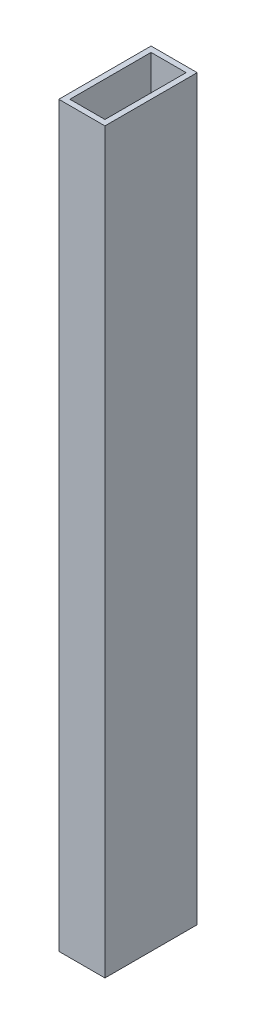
ISO-10303-21;
HEADER;
FILE_DESCRIPTION(('STEP AP214'),'2;1');
FILE_NAME('part.step','',(''),(''),'','','');
FILE_SCHEMA(('AUTOMOTIVE_DESIGN { 1 0 10303 214 1 1 1 1 }'));
ENDSEC;
DATA;
#1=APPLICATION_CONTEXT('core data for automotive mechanical design processes');
#2=APPLICATION_PROTOCOL_DEFINITION('international standard','automotive_design',2000,#1);
#3=PRODUCT_CONTEXT('',#1,'mechanical');
#4=PRODUCT('Part','Part','',(#3));
#5=PRODUCT_RELATED_PRODUCT_CATEGORY('part','',(#4));
#6=PRODUCT_DEFINITION_FORMATION('','',#4);
#7=PRODUCT_DEFINITION_CONTEXT('part definition',#1,'design');
#8=PRODUCT_DEFINITION('design','',#6,#7);
#9=PRODUCT_DEFINITION_SHAPE('','',#8);
#10=(LENGTH_UNIT() NAMED_UNIT(*) SI_UNIT(.MILLI.,.METRE.));
#11=(NAMED_UNIT(*) PLANE_ANGLE_UNIT() SI_UNIT($,.RADIAN.));
#12=(NAMED_UNIT(*) SI_UNIT($,.STERADIAN.) SOLID_ANGLE_UNIT());
#13=UNCERTAINTY_MEASURE_WITH_UNIT(LENGTH_MEASURE(1.E-05),#10,'distance_accuracy_value','');
#14=(GEOMETRIC_REPRESENTATION_CONTEXT(3) GLOBAL_UNCERTAINTY_ASSIGNED_CONTEXT((#13)) GLOBAL_UNIT_ASSIGNED_CONTEXT((#10,
#11,#12)) REPRESENTATION_CONTEXT('',''));
#15=CARTESIAN_POINT('',(0.,0.,0.));
#16=DIRECTION('',(0.,0.,1.));
#17=DIRECTION('',(1.,0.,0.));
#18=AXIS2_PLACEMENT_3D('',#15,#16,#17);
#19=CARTESIAN_POINT('',(25.,0.,0.));
#20=DIRECTION('',(0.,0.,-1.));
#21=DIRECTION('',(-1.,0.,0.));
#22=AXIS2_PLACEMENT_3D('',#19,#20,#21);
#23=PLANE('',#22);
#24=DIRECTION('',(0.,-1.,0.));
#25=VECTOR('',#24,1.);
#26=CARTESIAN_POINT('',(0.,0.,0.));
#27=LINE('',#26,#25);
#28=CARTESIAN_POINT('',(0.,400.,0.));
#29=VERTEX_POINT('',#28);
#30=CARTESIAN_POINT('',(0.,0.,0.));
#31=VERTEX_POINT('',#30);
#32=EDGE_CURVE('E104',#29,#31,#27,.T.);
#33=ORIENTED_EDGE('',*,*,#32,.T.);
#34=DIRECTION('',(-1.,0.,0.));
#35=VECTOR('',#34,1.);
#36=CARTESIAN_POINT('',(25.,0.,0.));
#37=LINE('',#36,#35);
#38=CARTESIAN_POINT('',(25.,0.,0.));
#39=VERTEX_POINT('',#38);
#40=EDGE_CURVE('E11',#39,#31,#37,.T.);
#41=ORIENTED_EDGE('',*,*,#40,.F.);
#42=DIRECTION('',(0.,-1.,0.));
#43=VECTOR('',#42,1.);
#44=CARTESIAN_POINT('',(25.,0.,0.));
#45=LINE('',#44,#43);
#46=CARTESIAN_POINT('',(25.,400.,0.));
#47=VERTEX_POINT('',#46);
#48=EDGE_CURVE('E135',#47,#39,#45,.T.);
#49=ORIENTED_EDGE('',*,*,#48,.F.);
#50=DIRECTION('',(-1.,0.,0.));
#51=VECTOR('',#50,1.);
#52=CARTESIAN_POINT('',(25.,400.,0.));
#53=LINE('',#52,#51);
#54=EDGE_CURVE('E144',#47,#29,#53,.T.);
#55=ORIENTED_EDGE('',*,*,#54,.T.);
#56=EDGE_LOOP('',(#33,#41,#49,#55));
#57=FACE_BOUND('',#56,.T.);
#58=ADVANCED_FACE('F26',(#57),#23,.F.);
#59=CARTESIAN_POINT('',(25.,0.,0.));
#60=DIRECTION('',(0.,1.,0.));
#61=DIRECTION('',(0.,0.,1.));
#62=AXIS2_PLACEMENT_3D('',#59,#60,#61);
#63=PLANE('',#62);
#64=DIRECTION('',(1.,0.,0.));
#65=VECTOR('',#64,1.);
#66=CARTESIAN_POINT('',(3.,0.,-47.));
#67=LINE('',#66,#65);
#68=CARTESIAN_POINT('',(3.00000000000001,0.,-47.));
#69=VERTEX_POINT('',#68);
#70=CARTESIAN_POINT('',(22.,0.,-47.));
#71=VERTEX_POINT('',#70);
#72=EDGE_CURVE('E112',#69,#71,#67,.T.);
#73=ORIENTED_EDGE('',*,*,#72,.F.);
#74=DIRECTION('',(0.,0.,-1.));
#75=VECTOR('',#74,1.);
#76=CARTESIAN_POINT('',(3.,0.,-3.));
#77=LINE('',#76,#75);
#78=CARTESIAN_POINT('',(3.,0.,-3.));
#79=VERTEX_POINT('',#78);
#80=EDGE_CURVE('E40',#79,#69,#77,.T.);
#81=ORIENTED_EDGE('',*,*,#80,.F.);
#82=DIRECTION('',(-1.,0.,0.));
#83=VECTOR('',#82,1.);
#84=CARTESIAN_POINT('',(3.,0.,-3.));
#85=LINE('',#84,#83);
#86=CARTESIAN_POINT('',(22.,0.,-3.));
#87=VERTEX_POINT('',#86);
#88=EDGE_CURVE('E98',#87,#79,#85,.T.);
#89=ORIENTED_EDGE('',*,*,#88,.F.);
#90=DIRECTION('',(0.,0.,1.));
#91=VECTOR('',#90,1.);
#92=CARTESIAN_POINT('',(22.,0.,-3.));
#93=LINE('',#92,#91);
#94=EDGE_CURVE('E118',#71,#87,#93,.T.);
#95=ORIENTED_EDGE('',*,*,#94,.F.);
#96=EDGE_LOOP('',(#73,#81,#89,#95));
#97=FACE_BOUND('',#96,.T.);
#98=DIRECTION('',(0.,0.,-1.));
#99=VECTOR('',#98,1.);
#100=CARTESIAN_POINT('',(0.,0.,0.));
#101=LINE('',#100,#99);
#102=CARTESIAN_POINT('',(0.,0.,-50.));
#103=VERTEX_POINT('',#102);
#104=EDGE_CURVE('E129',#31,#103,#101,.T.);
#105=ORIENTED_EDGE('',*,*,#104,.T.);
#106=DIRECTION('',(-1.,0.,0.));
#107=VECTOR('',#106,1.);
#108=CARTESIAN_POINT('',(25.,0.,-50.));
#109=LINE('',#108,#107);
#110=CARTESIAN_POINT('',(25.,0.,-50.));
#111=VERTEX_POINT('',#110);
#112=EDGE_CURVE('E33',#111,#103,#109,.T.);
#113=ORIENTED_EDGE('',*,*,#112,.F.);
#114=DIRECTION('',(0.,0.,-1.));
#115=VECTOR('',#114,1.);
#116=CARTESIAN_POINT('',(25.,0.,0.));
#117=LINE('',#116,#115);
#118=EDGE_CURVE('E138',#39,#111,#117,.T.);
#119=ORIENTED_EDGE('',*,*,#118,.F.);
#120=ORIENTED_EDGE('',*,*,#40,.T.);
#121=EDGE_LOOP('',(#105,#113,#119,#120));
#122=FACE_BOUND('',#121,.T.);
#123=ADVANCED_FACE('F168',(#97,#122),#63,.F.);
#124=CARTESIAN_POINT('',(25.,0.,-50.));
#125=DIRECTION('',(0.,0.,1.));
#126=DIRECTION('',(1.,0.,0.));
#127=AXIS2_PLACEMENT_3D('',#124,#125,#126);
#128=PLANE('',#127);
#129=DIRECTION('',(0.,1.,0.));
#130=VECTOR('',#129,1.);
#131=CARTESIAN_POINT('',(0.,0.,-50.));
#132=LINE('',#131,#130);
#133=CARTESIAN_POINT('',(0.,400.,-50.));
#134=VERTEX_POINT('',#133);
#135=EDGE_CURVE('E131',#103,#134,#132,.T.);
#136=ORIENTED_EDGE('',*,*,#135,.T.);
#137=DIRECTION('',(-1.,0.,0.));
#138=VECTOR('',#137,1.);
#139=CARTESIAN_POINT('',(25.,400.,-50.));
#140=LINE('',#139,#138);
#141=CARTESIAN_POINT('',(25.,400.,-50.));
#142=VERTEX_POINT('',#141);
#143=EDGE_CURVE('E147',#142,#134,#140,.T.);
#144=ORIENTED_EDGE('',*,*,#143,.F.);
#145=DIRECTION('',(0.,1.,0.));
#146=VECTOR('',#145,1.);
#147=CARTESIAN_POINT('',(25.,0.,-50.));
#148=LINE('',#147,#146);
#149=EDGE_CURVE('E140',#111,#142,#148,.T.);
#150=ORIENTED_EDGE('',*,*,#149,.F.);
#151=ORIENTED_EDGE('',*,*,#112,.T.);
#152=EDGE_LOOP('',(#136,#144,#150,#151));
#153=FACE_BOUND('',#152,.T.);
#154=ADVANCED_FACE('F154',(#153),#128,.F.);
#155=CARTESIAN_POINT('',(25.,400.,0.));
#156=DIRECTION('',(0.,-1.,0.));
#157=DIRECTION('',(0.,0.,-1.));
#158=AXIS2_PLACEMENT_3D('',#155,#156,#157);
#159=PLANE('',#158);
#160=DIRECTION('',(1.,0.,0.));
#161=VECTOR('',#160,1.);
#162=CARTESIAN_POINT('',(3.,400.,-3.));
#163=LINE('',#162,#161);
#164=CARTESIAN_POINT('',(3.,400.,-3.));
#165=VERTEX_POINT('',#164);
#166=CARTESIAN_POINT('',(22.,400.,-3.));
#167=VERTEX_POINT('',#166);
#168=EDGE_CURVE('E110',#165,#167,#163,.T.);
#169=ORIENTED_EDGE('',*,*,#168,.F.);
#170=DIRECTION('',(0.,0.,1.));
#171=VECTOR('',#170,1.);
#172=CARTESIAN_POINT('',(3.,400.,-3.));
#173=LINE('',#172,#171);
#174=CARTESIAN_POINT('',(3.,400.,-47.));
#175=VERTEX_POINT('',#174);
#176=EDGE_CURVE('E92',#175,#165,#173,.T.);
#177=ORIENTED_EDGE('',*,*,#176,.F.);
#178=DIRECTION('',(-1.,0.,0.));
#179=VECTOR('',#178,1.);
#180=CARTESIAN_POINT('',(3.,400.,-47.));
#181=LINE('',#180,#179);
#182=CARTESIAN_POINT('',(22.,400.,-47.));
#183=VERTEX_POINT('',#182);
#184=EDGE_CURVE('E101',#183,#175,#181,.T.);
#185=ORIENTED_EDGE('',*,*,#184,.F.);
#186=DIRECTION('',(0.,0.,-1.));
#187=VECTOR('',#186,1.);
#188=CARTESIAN_POINT('',(22.,400.,-3.));
#189=LINE('',#188,#187);
#190=EDGE_CURVE('E48',#167,#183,#189,.T.);
#191=ORIENTED_EDGE('',*,*,#190,.F.);
#192=EDGE_LOOP('',(#169,#177,#185,#191));
#193=FACE_BOUND('',#192,.T.);
#194=DIRECTION('',(0.,0.,1.));
#195=VECTOR('',#194,1.);
#196=CARTESIAN_POINT('',(0.,400.,0.));
#197=LINE('',#196,#195);
#198=EDGE_CURVE('E133',#134,#29,#197,.T.);
#199=ORIENTED_EDGE('',*,*,#198,.T.);
#200=ORIENTED_EDGE('',*,*,#54,.F.);
#201=DIRECTION('',(0.,0.,1.));
#202=VECTOR('',#201,1.);
#203=CARTESIAN_POINT('',(25.,400.,0.));
#204=LINE('',#203,#202);
#205=EDGE_CURVE('E142',#142,#47,#204,.T.);
#206=ORIENTED_EDGE('',*,*,#205,.F.);
#207=ORIENTED_EDGE('',*,*,#143,.T.);
#208=EDGE_LOOP('',(#199,#200,#206,#207));
#209=FACE_BOUND('',#208,.T.);
#210=ADVANCED_FACE('F107',(#193,#209),#159,.F.);
#211=CARTESIAN_POINT('',(25.,400.,0.));
#212=DIRECTION('',(-1.,0.,0.));
#213=DIRECTION('',(0.,0.,1.));
#214=AXIS2_PLACEMENT_3D('',#211,#212,#213);
#215=PLANE('',#214);
#216=ORIENTED_EDGE('',*,*,#48,.T.);
#217=ORIENTED_EDGE('',*,*,#118,.T.);
#218=ORIENTED_EDGE('',*,*,#149,.T.);
#219=ORIENTED_EDGE('',*,*,#205,.T.);
#220=EDGE_LOOP('',(#216,#217,#218,#219));
#221=FACE_BOUND('',#220,.T.);
#222=ADVANCED_FACE('F167',(#221),#215,.F.);
#223=CARTESIAN_POINT('',(0.,400.,0.));
#224=DIRECTION('',(-1.,0.,0.));
#225=DIRECTION('',(0.,0.,1.));
#226=AXIS2_PLACEMENT_3D('',#223,#224,#225);
#227=PLANE('',#226);
#228=ORIENTED_EDGE('',*,*,#32,.F.);
#229=ORIENTED_EDGE('',*,*,#198,.F.);
#230=ORIENTED_EDGE('',*,*,#135,.F.);
#231=ORIENTED_EDGE('',*,*,#104,.F.);
#232=EDGE_LOOP('',(#228,#229,#230,#231));
#233=FACE_BOUND('',#232,.T.);
#234=ADVANCED_FACE('F160',(#233),#227,.T.);
#235=CARTESIAN_POINT('',(3.,400.001,-3.));
#236=DIRECTION('',(-1.,0.,0.));
#237=DIRECTION('',(0.,0.,1.));
#238=AXIS2_PLACEMENT_3D('',#235,#236,#237);
#239=PLANE('',#238);
#240=ORIENTED_EDGE('',*,*,#176,.T.);
#241=DIRECTION('',(0.,-1.,0.));
#242=VECTOR('',#241,1.);
#243=CARTESIAN_POINT('',(3.,400.001,-3.));
#244=LINE('',#243,#242);
#245=EDGE_CURVE('E105',#165,#79,#244,.T.);
#246=ORIENTED_EDGE('',*,*,#245,.T.);
#247=ORIENTED_EDGE('',*,*,#80,.T.);
#248=DIRECTION('',(0.,-1.,0.));
#249=VECTOR('',#248,1.);
#250=CARTESIAN_POINT('',(3.,400.001,-47.));
#251=LINE('',#250,#249);
#252=EDGE_CURVE('E88',#175,#69,#251,.T.);
#253=ORIENTED_EDGE('',*,*,#252,.F.);
#254=EDGE_LOOP('',(#240,#246,#247,#253));
#255=FACE_BOUND('',#254,.T.);
#256=ADVANCED_FACE('F90',(#255),#239,.F.);
#257=CARTESIAN_POINT('',(3.,400.001,-3.));
#258=DIRECTION('',(0.,0.,1.));
#259=DIRECTION('',(1.,0.,0.));
#260=AXIS2_PLACEMENT_3D('',#257,#258,#259);
#261=PLANE('',#260);
#262=ORIENTED_EDGE('',*,*,#168,.T.);
#263=DIRECTION('',(0.,-1.,0.));
#264=VECTOR('',#263,1.);
#265=CARTESIAN_POINT('',(22.,400.001,-3.));
#266=LINE('',#265,#264);
#267=EDGE_CURVE('E124',#167,#87,#266,.T.);
#268=ORIENTED_EDGE('',*,*,#267,.T.);
#269=ORIENTED_EDGE('',*,*,#88,.T.);
#270=ORIENTED_EDGE('',*,*,#245,.F.);
#271=EDGE_LOOP('',(#262,#268,#269,#270));
#272=FACE_BOUND('',#271,.T.);
#273=ADVANCED_FACE('F185',(#272),#261,.F.);
#274=CARTESIAN_POINT('',(22.,400.001,-3.));
#275=DIRECTION('',(1.,0.,0.));
#276=DIRECTION('',(0.,0.,-1.));
#277=AXIS2_PLACEMENT_3D('',#274,#275,#276);
#278=PLANE('',#277);
#279=ORIENTED_EDGE('',*,*,#190,.T.);
#280=DIRECTION('',(0.,-1.,0.));
#281=VECTOR('',#280,1.);
#282=CARTESIAN_POINT('',(22.,400.001,-47.));
#283=LINE('',#282,#281);
#284=EDGE_CURVE('E97',#183,#71,#283,.T.);
#285=ORIENTED_EDGE('',*,*,#284,.T.);
#286=ORIENTED_EDGE('',*,*,#94,.T.);
#287=ORIENTED_EDGE('',*,*,#267,.F.);
#288=EDGE_LOOP('',(#279,#285,#286,#287));
#289=FACE_BOUND('',#288,.T.);
#290=ADVANCED_FACE('F188',(#289),#278,.F.);
#291=CARTESIAN_POINT('',(3.,400.001,-47.));
#292=DIRECTION('',(0.,0.,-1.));
#293=DIRECTION('',(-1.,0.,0.));
#294=AXIS2_PLACEMENT_3D('',#291,#292,#293);
#295=PLANE('',#294);
#296=ORIENTED_EDGE('',*,*,#184,.T.);
#297=ORIENTED_EDGE('',*,*,#252,.T.);
#298=ORIENTED_EDGE('',*,*,#72,.T.);
#299=ORIENTED_EDGE('',*,*,#284,.F.);
#300=EDGE_LOOP('',(#296,#297,#298,#299));
#301=FACE_BOUND('',#300,.T.);
#302=ADVANCED_FACE('F102',(#301),#295,.F.);
#303=CLOSED_SHELL('',(#58,#123,#154,#210,#222,#234,#256,#273,#290,#302));
#304=MANIFOLD_SOLID_BREP('B2',#303);
#305=ADVANCED_BREP_SHAPE_REPRESENTATION('',(#18,#304),#14);
#306=SHAPE_DEFINITION_REPRESENTATION(#9,#305);
ENDSEC;
END-ISO-10303-21;
